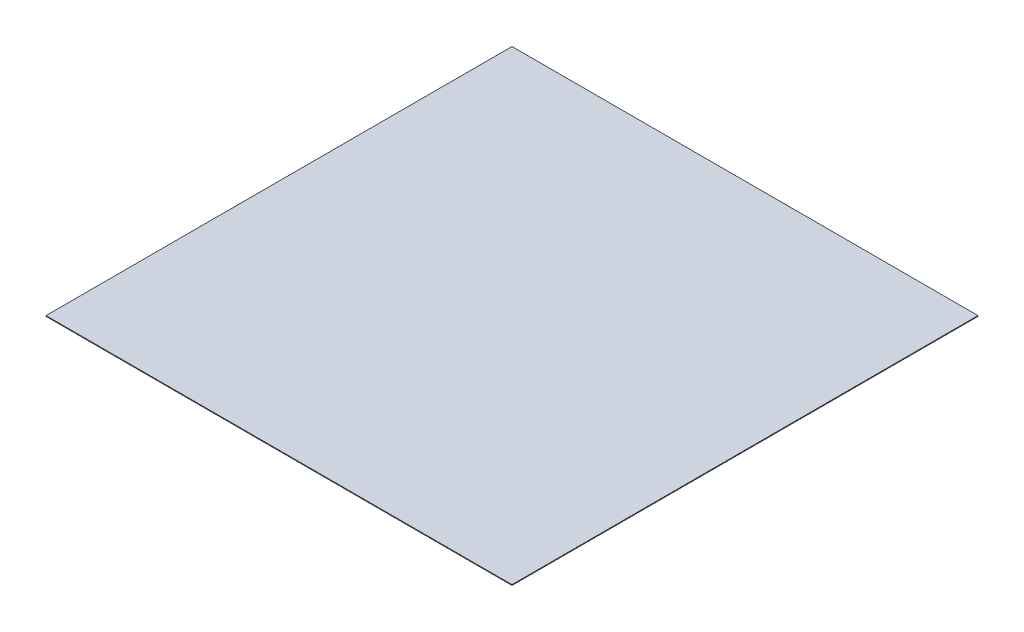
from build123d import *

# Parameters (mm, degrees)
SKETCH1_W      = 1219.2
SKETCH1_H      = 1219.2
EXTRUDE1_DEPTH = 1.905


with BuildPart() as part:
    # Sketch1 → Extrude1 (new body)
    with BuildSketch(Plane(origin=(0, 0, 0), x_dir=(1, 0, 0), z_dir=(0, 1, 0))):
        Rectangle(SKETCH1_W, SKETCH1_H)
    extrude(amount=EXTRUDE1_DEPTH)


solid = part.part
